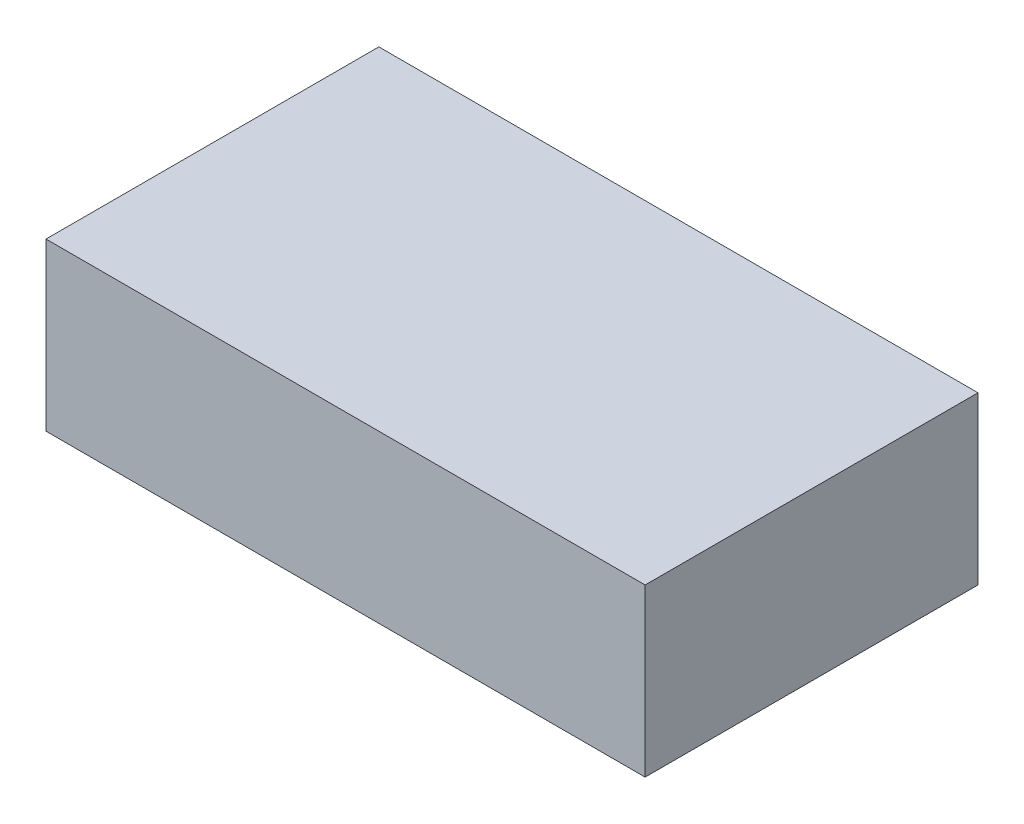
from build123d import *

# Parameters (mm, degrees)
BASESKETCH_W   = 90
BASESKETCH_H   = 50
BASEBOSS_DEPTH = 25


with BuildPart() as part:
    # BaseSketch → BaseBoss (new body)
    with BuildSketch(Plane(origin=(0, 0, 0), x_dir=(1, 0, 0), z_dir=(0, 1, 0))):
        with Locations((45, 25)):
            Rectangle(BASESKETCH_W, BASESKETCH_H)
    extrude(amount=-BASEBOSS_DEPTH)


solid = part.part
